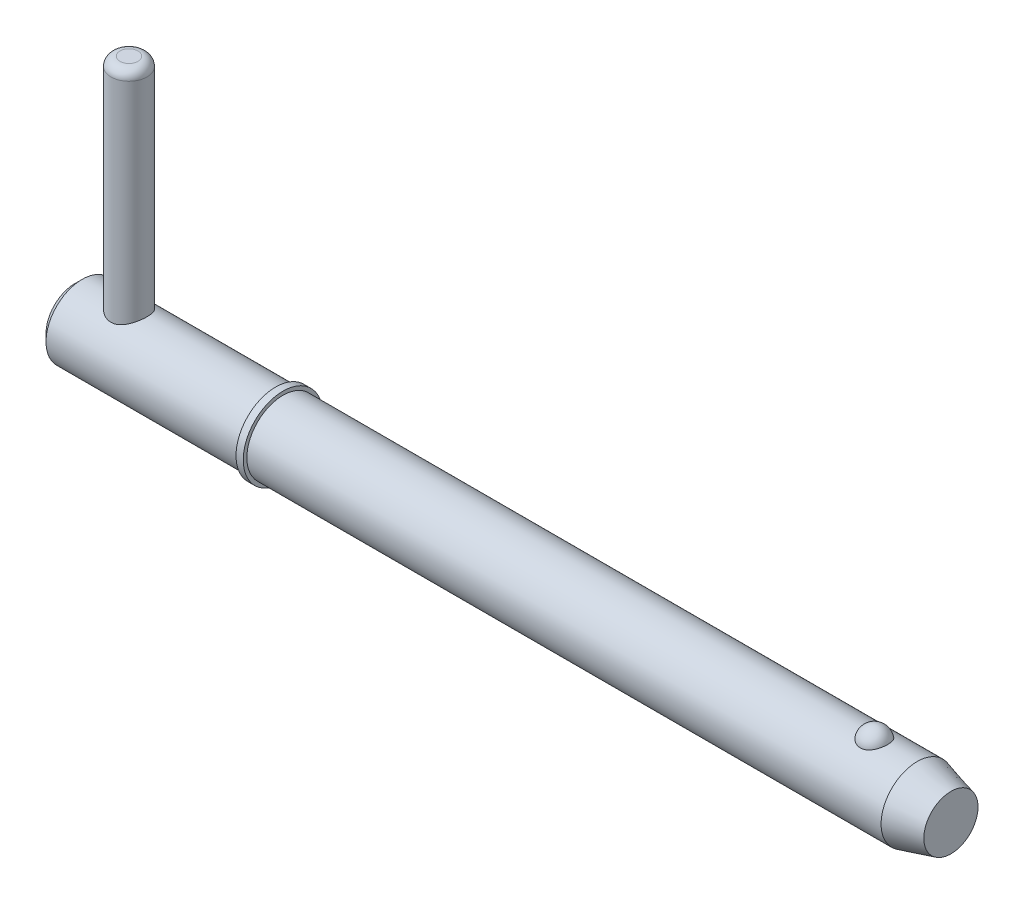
ISO-10303-21;
HEADER;
FILE_DESCRIPTION(('STEP AP214'),'2;1');
FILE_NAME('part.step','',(''),(''),'','','');
FILE_SCHEMA(('AUTOMOTIVE_DESIGN { 1 0 10303 214 1 1 1 1 }'));
ENDSEC;
DATA;
#1=APPLICATION_CONTEXT('core data for automotive mechanical design processes');
#2=APPLICATION_PROTOCOL_DEFINITION('international standard','automotive_design',2000,#1);
#3=PRODUCT_CONTEXT('',#1,'mechanical');
#4=PRODUCT('Part','Part','',(#3));
#5=PRODUCT_RELATED_PRODUCT_CATEGORY('part','',(#4));
#6=PRODUCT_DEFINITION_FORMATION('','',#4);
#7=PRODUCT_DEFINITION_CONTEXT('part definition',#1,'design');
#8=PRODUCT_DEFINITION('design','',#6,#7);
#9=PRODUCT_DEFINITION_SHAPE('','',#8);
#10=(LENGTH_UNIT() NAMED_UNIT(*) SI_UNIT(.MILLI.,.METRE.));
#11=(NAMED_UNIT(*) PLANE_ANGLE_UNIT() SI_UNIT($,.RADIAN.));
#12=(NAMED_UNIT(*) SI_UNIT($,.STERADIAN.) SOLID_ANGLE_UNIT());
#13=UNCERTAINTY_MEASURE_WITH_UNIT(LENGTH_MEASURE(1.E-05),#10,'distance_accuracy_value','');
#14=(GEOMETRIC_REPRESENTATION_CONTEXT(3) GLOBAL_UNCERTAINTY_ASSIGNED_CONTEXT((#13)) GLOBAL_UNIT_ASSIGNED_CONTEXT((#10,
#11,#12)) REPRESENTATION_CONTEXT('',''));
#15=CARTESIAN_POINT('',(0.,0.,0.));
#16=DIRECTION('',(0.,0.,1.));
#17=DIRECTION('',(1.,0.,0.));
#18=AXIS2_PLACEMENT_3D('',#15,#16,#17);
#19=CARTESIAN_POINT('',(4.755,22.225,0.));
#20=DIRECTION('',(0.,-1.,0.));
#21=DIRECTION('',(0.,0.,-1.));
#22=AXIS2_PLACEMENT_3D('',#19,#20,#21);
#23=CYLINDRICAL_SURFACE('',#22,1.585);
#24=CARTESIAN_POINT('',(4.755,-2.3825,0.));
#25=DIRECTION('',(0.,1.,0.));
#26=DIRECTION('',(0.,0.,1.));
#27=AXIS2_PLACEMENT_3D('',#24,#25,#26);
#28=CIRCLE('',#27,1.585);
#29=CARTESIAN_POINT('',(4.755,-2.3825,1.585));
#30=VERTEX_POINT('',#29);
#31=EDGE_CURVE('P0_E25',#30,#30,#28,.T.);
#32=ORIENTED_EDGE('',*,*,#31,.T.);
#33=EDGE_LOOP('',(#32));
#34=FACE_BOUND('',#33,.T.);
#35=CARTESIAN_POINT('',(4.755,21.4325,0.));
#36=DIRECTION('',(0.,1.,0.));
#37=DIRECTION('',(0.,0.,1.));
#38=AXIS2_PLACEMENT_3D('',#35,#36,#37);
#39=CIRCLE('',#38,1.585);
#40=CARTESIAN_POINT('',(4.755,21.4325,1.585));
#41=VERTEX_POINT('',#40);
#42=EDGE_CURVE('P0_E29',#41,#41,#39,.F.);
#43=ORIENTED_EDGE('',*,*,#42,.T.);
#44=EDGE_LOOP('',(#43));
#45=FACE_BOUND('',#44,.T.);
#46=ADVANCED_FACE('P0_F14',(#34,#45),#23,.T.);
#47=CARTESIAN_POINT('',(4.755,22.225,0.));
#48=DIRECTION('',(0.,1.,0.));
#49=DIRECTION('',(0.,0.,1.));
#50=AXIS2_PLACEMENT_3D('',#47,#48,#49);
#51=PLANE('',#50);
#52=CARTESIAN_POINT('',(4.755,22.225,0.));
#53=DIRECTION('',(0.,1.,0.));
#54=DIRECTION('',(0.,0.,1.));
#55=AXIS2_PLACEMENT_3D('',#52,#53,#54);
#56=CIRCLE('',#55,0.7925);
#57=CARTESIAN_POINT('',(4.755,22.225,0.7925));
#58=VERTEX_POINT('',#57);
#59=EDGE_CURVE('P0_E10',#58,#58,#56,.T.);
#60=ORIENTED_EDGE('',*,*,#59,.T.);
#61=EDGE_LOOP('',(#60));
#62=FACE_BOUND('',#61,.T.);
#63=ADVANCED_FACE('P0_F46',(#62),#51,.T.);
#64=CARTESIAN_POINT('',(4.755,-3.175,0.));
#65=DIRECTION('',(0.,1.,0.));
#66=DIRECTION('',(0.,0.,1.));
#67=AXIS2_PLACEMENT_3D('',#64,#65,#66);
#68=PLANE('',#67);
#69=CARTESIAN_POINT('',(4.755,-3.175,0.));
#70=DIRECTION('',(0.,1.,0.));
#71=DIRECTION('',(0.,0.,1.));
#72=AXIS2_PLACEMENT_3D('',#69,#70,#71);
#73=CIRCLE('',#72,0.7925);
#74=CARTESIAN_POINT('',(4.755,-3.175,0.7925));
#75=VERTEX_POINT('',#74);
#76=EDGE_CURVE('P0_E21',#75,#75,#73,.F.);
#77=ORIENTED_EDGE('',*,*,#76,.T.);
#78=EDGE_LOOP('',(#77));
#79=FACE_BOUND('',#78,.T.);
#80=ADVANCED_FACE('P0_F43',(#79),#68,.F.);
#81=CARTESIAN_POINT('',(4.755,-2.3825,0.));
#82=DIRECTION('',(0.,1.,0.));
#83=DIRECTION('',(0.,0.,1.));
#84=AXIS2_PLACEMENT_3D('',#81,#82,#83);
#85=DEGENERATE_TOROIDAL_SURFACE('',#84,0.7925,0.7925,.T.);
#86=ORIENTED_EDGE('',*,*,#76,.F.);
#87=EDGE_LOOP('',(#86));
#88=FACE_BOUND('',#87,.T.);
#89=ORIENTED_EDGE('',*,*,#31,.F.);
#90=EDGE_LOOP('',(#89));
#91=FACE_BOUND('',#90,.T.);
#92=ADVANCED_FACE('P0_F38',(#88,#91),#85,.T.);
#93=CARTESIAN_POINT('',(4.755,21.4325,0.));
#94=DIRECTION('',(0.,1.,0.));
#95=DIRECTION('',(0.,0.,1.));
#96=AXIS2_PLACEMENT_3D('',#93,#94,#95);
#97=DEGENERATE_TOROIDAL_SURFACE('',#96,0.7925,0.7925,.T.);
#98=ORIENTED_EDGE('',*,*,#42,.F.);
#99=EDGE_LOOP('',(#98));
#100=FACE_BOUND('',#99,.T.);
#101=ORIENTED_EDGE('',*,*,#59,.F.);
#102=EDGE_LOOP('',(#101));
#103=FACE_BOUND('',#102,.T.);
#104=ADVANCED_FACE('P0_F16',(#100,#103),#97,.T.);
#105=CLOSED_SHELL('',(#46,#63,#80,#92,#104));
#106=MANIFOLD_SOLID_BREP('P0_B1',#105);
#107=CARTESIAN_POINT('',(0.,0.,0.));
#108=DIRECTION('',(1.,0.,0.));
#109=DIRECTION('',(0.,0.,-1.));
#110=AXIS2_PLACEMENT_3D('',#107,#108,#109);
#111=CYLINDRICAL_SURFACE('',#110,3.175);
#112=CARTESIAN_POINT('',(74.0476846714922,0.,0.));
#113=DIRECTION('',(1.,0.,0.));
#114=DIRECTION('',(0.,0.,-1.));
#115=AXIS2_PLACEMENT_3D('',#112,#113,#114);
#116=CIRCLE('',#115,3.175);
#117=CARTESIAN_POINT('',(74.0476846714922,0.,-3.175));
#118=VERTEX_POINT('',#117);
#119=EDGE_CURVE('P1_E81',#118,#118,#116,.T.);
#120=ORIENTED_EDGE('',*,*,#119,.F.);
#121=EDGE_LOOP('',(#120));
#122=FACE_BOUND('',#121,.T.);
#123=CARTESIAN_POINT('',(18.29,0.,0.));
#124=DIRECTION('',(1.,0.,0.));
#125=DIRECTION('',(0.,0.,-1.));
#126=AXIS2_PLACEMENT_3D('',#123,#124,#125);
#127=CIRCLE('',#126,3.175);
#128=CARTESIAN_POINT('',(18.29,0.,-3.175));
#129=VERTEX_POINT('',#128);
#130=EDGE_CURVE('P1_E85',#129,#129,#127,.T.);
#131=ORIENTED_EDGE('',*,*,#130,.T.);
#132=EDGE_LOOP('',(#131));
#133=FACE_BOUND('',#132,.T.);
#134=CARTESIAN_POINT('',(70.2757276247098,2.92898950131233,1.2254164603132));
#135=CARTESIAN_POINT('',(70.212316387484,2.92899434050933,1.22541146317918));
#136=CARTESIAN_POINT('',(70.1487979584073,2.93112688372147,1.2203464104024));
#137=CARTESIAN_POINT('',(70.0235306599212,2.93942752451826,1.20020949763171));
#138=CARTESIAN_POINT('',(69.9617869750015,2.9456063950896,1.1851109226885));
#139=CARTESIAN_POINT('',(69.8420651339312,2.96127115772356,1.14540352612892));
#140=CARTESIAN_POINT('',(69.7840775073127,2.97074831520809,1.12081980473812));
#141=CARTESIAN_POINT('',(69.6731943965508,2.99197584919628,1.06285154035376));
#142=CARTESIAN_POINT('',(69.6202966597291,3.0037252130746,1.02947091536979));
#143=CARTESIAN_POINT('',(69.5192688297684,3.02865714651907,0.953674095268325));
#144=CARTESIAN_POINT('',(69.471324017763,3.04187163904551,0.911021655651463));
#145=CARTESIAN_POINT('',(69.3830360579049,3.06808741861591,0.818400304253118));
#146=CARTESIAN_POINT('',(69.3426952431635,3.08108863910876,0.768429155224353));
#147=CARTESIAN_POINT('',(69.2688039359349,3.10614903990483,0.660064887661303));
#148=CARTESIAN_POINT('',(69.2356330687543,3.11814104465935,0.601396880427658));
#149=CARTESIAN_POINT('',(69.1791190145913,3.13926931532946,0.479026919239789));
#150=CARTESIAN_POINT('',(69.1557764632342,3.14840539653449,0.415324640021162));
#151=CARTESIAN_POINT('',(69.1191785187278,3.16298160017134,0.283885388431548));
#152=CARTESIAN_POINT('',(69.1060407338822,3.16837855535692,0.216110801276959));
#153=CARTESIAN_POINT('',(69.0905676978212,3.17475386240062,0.0791367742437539));
#154=CARTESIAN_POINT('',(69.088232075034,3.17573236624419,0.00993738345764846));
#155=CARTESIAN_POINT('',(69.094388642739,3.17318075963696,-0.127420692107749));
#156=CARTESIAN_POINT('',(69.1028073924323,3.16968122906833,-0.19558325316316));
#157=CARTESIAN_POINT('',(69.1301752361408,3.1585790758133,-0.329413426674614));
#158=CARTESIAN_POINT('',(69.1491245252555,3.15097637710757,-0.395080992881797));
#159=CARTESIAN_POINT('',(69.1972057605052,3.13242485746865,-0.5221806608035));
#160=CARTESIAN_POINT('',(69.2263524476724,3.12147119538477,-0.583606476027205));
#161=CARTESIAN_POINT('',(69.2942352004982,3.09734973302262,-0.700436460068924));
#162=CARTESIAN_POINT('',(69.332972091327,3.08418174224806,-0.755840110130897));
#163=CARTESIAN_POINT('',(69.4194771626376,3.05694884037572,-0.859404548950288));
#164=CARTESIAN_POINT('',(69.4672961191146,3.04287919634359,-0.907521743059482));
#165=CARTESIAN_POINT('',(69.5707353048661,3.01548927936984,-0.994758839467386));
#166=CARTESIAN_POINT('',(69.6263549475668,3.0021689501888,-1.03387941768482));
#167=CARTESIAN_POINT('',(69.7428093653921,2.97810316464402,-1.10126594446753));
#168=CARTESIAN_POINT('',(69.8035182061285,2.96731170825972,-1.12973256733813));
#169=CARTESIAN_POINT('',(69.9293712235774,2.94928934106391,-1.17598467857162));
#170=CARTESIAN_POINT('',(69.9945137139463,2.94205708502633,-1.19377420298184));
#171=CARTESIAN_POINT('',(70.1238562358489,2.93233065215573,-1.21746387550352));
#172=CARTESIAN_POINT('',(70.1879385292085,2.92961621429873,-1.22391763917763));
#173=CARTESIAN_POINT('',(70.3163375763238,2.92855752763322,-1.22644976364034));
#174=CARTESIAN_POINT('',(70.3806542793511,2.93021238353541,-1.22253024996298));
#175=CARTESIAN_POINT('',(70.5055239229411,2.9375685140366,-1.20474140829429));
#176=CARTESIAN_POINT('',(70.566131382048,2.94313790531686,-1.19119621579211));
#177=CARTESIAN_POINT('',(70.6841106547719,2.95756226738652,-1.15491492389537));
#178=CARTESIAN_POINT('',(70.7414822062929,2.96641750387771,-1.13217808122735));
#179=CARTESIAN_POINT('',(70.8527699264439,2.98669918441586,-1.07755083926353));
#180=CARTESIAN_POINT('',(70.9065845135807,2.9981771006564,-1.04547308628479));
#181=CARTESIAN_POINT('',(71.0081473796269,3.02240235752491,-0.973220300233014));
#182=CARTESIAN_POINT('',(71.0558942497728,3.03514999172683,-0.933043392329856));
#183=CARTESIAN_POINT('',(71.1465817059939,3.06131230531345,-0.843372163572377));
#184=CARTESIAN_POINT('',(71.1891588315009,3.07472822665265,-0.793510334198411));
#185=CARTESIAN_POINT('',(71.2656765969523,3.10021106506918,-0.687241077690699));
#186=CARTESIAN_POINT('',(71.2996156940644,3.1122777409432,-0.630832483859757));
#187=CARTESIAN_POINT('',(71.3591209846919,3.134208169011,-0.51105938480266));
#188=CARTESIAN_POINT('',(71.3843892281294,3.14399040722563,-0.447531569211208));
#189=CARTESIAN_POINT('',(71.4245117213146,3.15983820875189,-0.31682749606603));
#190=CARTESIAN_POINT('',(71.4393659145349,3.16590375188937,-0.249651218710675));
#191=CARTESIAN_POINT('',(71.458358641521,3.17370076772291,-0.113549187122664));
#192=CARTESIAN_POINT('',(71.4624966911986,3.17543204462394,-0.0446233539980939));
#193=CARTESIAN_POINT('',(71.4599697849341,3.17438372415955,0.0929938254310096));
#194=CARTESIAN_POINT('',(71.4533050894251,3.17160423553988,0.16168517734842));
#195=CARTESIAN_POINT('',(71.4293754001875,3.1618438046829,0.296502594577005));
#196=CARTESIAN_POINT('',(71.4121674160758,3.15488546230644,0.362640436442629));
#197=CARTESIAN_POINT('',(71.367547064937,3.13748892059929,0.490896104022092));
#198=CARTESIAN_POINT('',(71.3401339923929,3.12705048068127,0.553013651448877));
#199=CARTESIAN_POINT('',(71.2754626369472,3.10369139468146,0.671876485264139));
#200=CARTESIAN_POINT('',(71.2381467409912,3.0907563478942,0.72858760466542));
#201=CARTESIAN_POINT('',(71.1545246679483,3.06381731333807,0.834653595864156));
#202=CARTESIAN_POINT('',(71.1082189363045,3.04981337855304,0.884008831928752));
#203=CARTESIAN_POINT('',(71.007718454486,3.02230423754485,0.973916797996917));
#204=CARTESIAN_POINT('',(70.953535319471,3.00879833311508,1.01448227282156));
#205=CARTESIAN_POINT('',(70.8385299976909,2.98383625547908,1.0857155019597));
#206=CARTESIAN_POINT('',(70.7777053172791,2.9723808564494,1.11637952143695));
#207=CARTESIAN_POINT('',(70.6533690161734,2.95329063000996,1.16592590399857));
#208=CARTESIAN_POINT('',(70.5900230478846,2.9455373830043,1.18517901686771));
#209=CARTESIAN_POINT('',(70.4607664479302,2.9342556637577,1.21284802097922));
#210=CARTESIAN_POINT('',(70.3948641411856,2.93071450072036,1.2212964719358));
#211=CARTESIAN_POINT('',(70.311116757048,2.9291525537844,1.22502505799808));
#212=CARTESIAN_POINT('',(70.2934263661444,2.92898815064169,1.22541785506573));
#213=CARTESIAN_POINT('',(70.2757276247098,2.92898950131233,1.2254164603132));
#214=B_SPLINE_CURVE_WITH_KNOTS('',3,(#134,#135,#136,#137,#138,#139,#140,#141,#142,#143,#144,
#145,#146,#147,#148,#149,#150,#151,#152,#153,#154,#155,#156,#157,#158,#159,#160,#161,#162,#163,
#164,#165,#166,#167,#168,#169,#170,#171,#172,#173,#174,#175,#176,#177,#178,#179,#180,#181,#182,
#183,#184,#185,#186,#187,#188,#189,#190,#191,#192,#193,#194,#195,#196,#197,#198,#199,#200,#201,
#202,#203,#204,#205,#206,#207,#208,#209,#210,#211,#212,#213),.UNSPECIFIED.,.T.,.F.,(4,2,2,2,2,2,
2,2,2,2,2,2,2,2,2,2,2,2,2,2,2,2,2,2,2,2,2,2,2,2,2,2,2,2,2,2,2,2,2,4),(0.,0.190186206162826,
0.380880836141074,0.571074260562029,0.761183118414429,0.956866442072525,1.15260970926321,
1.3570177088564,1.56143892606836,1.76818248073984,1.97491892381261,2.18025109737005,
2.38558707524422,2.59122111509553,2.79687285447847,3.00371012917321,3.2105318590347,
3.41323429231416,3.61586005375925,3.80828192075,4.00066436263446,4.18685798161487,
4.37306665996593,4.56330302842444,4.75358348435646,4.95345287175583,5.15335793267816,
5.35957003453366,5.56578325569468,5.7720057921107,5.97822335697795,6.18333558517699,
6.38846199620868,6.59480900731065,6.80114579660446,7.00718137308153,7.21329457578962,
7.41228022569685,7.61066481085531,7.66374777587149),.UNSPECIFIED.);
#215=CARTESIAN_POINT('',(70.2757276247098,2.92898950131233,1.2254164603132));
#216=VERTEX_POINT('',#215);
#217=EDGE_CURVE('P1_E35',#216,#216,#214,.T.);
#218=ORIENTED_EDGE('',*,*,#217,.T.);
#219=EDGE_LOOP('',(#218));
#220=FACE_BOUND('',#219,.T.);
#221=ADVANCED_FACE('P1_F13',(#122,#133,#220),#111,.T.);
#222=CARTESIAN_POINT('',(0.,0.,0.));
#223=DIRECTION('',(-1.,0.,0.));
#224=DIRECTION('',(0.,0.,1.));
#225=AXIS2_PLACEMENT_3D('',#222,#223,#224);
#226=PLANE('',#225);
#227=CARTESIAN_POINT('',(0.,0.,0.));
#228=DIRECTION('',(1.,0.,0.));
#229=DIRECTION('',(0.,0.,-1.));
#230=AXIS2_PLACEMENT_3D('',#227,#228,#229);
#231=CIRCLE('',#230,2.54);
#232=CARTESIAN_POINT('',(0.,0.,-2.54));
#233=VERTEX_POINT('',#232);
#234=EDGE_CURVE('P1_E9',#233,#233,#231,.T.);
#235=ORIENTED_EDGE('',*,*,#234,.F.);
#236=EDGE_LOOP('',(#235));
#237=FACE_BOUND('',#236,.T.);
#238=ADVANCED_FACE('P1_F15',(#237),#226,.T.);
#239=CARTESIAN_POINT('',(0.634999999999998,0.,0.));
#240=DIRECTION('',(1.,0.,0.));
#241=DIRECTION('',(0.,0.,-1.));
#242=AXIS2_PLACEMENT_3D('',#239,#240,#241);
#243=CONICAL_SURFACE('',#242,3.175,0.78539816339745);
#244=ORIENTED_EDGE('',*,*,#234,.T.);
#245=EDGE_LOOP('',(#244));
#246=FACE_BOUND('',#245,.T.);
#247=CARTESIAN_POINT('',(0.634999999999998,0.,0.));
#248=DIRECTION('',(1.,0.,0.));
#249=DIRECTION('',(0.,0.,-1.));
#250=AXIS2_PLACEMENT_3D('',#247,#248,#249);
#251=CIRCLE('',#250,3.175);
#252=CARTESIAN_POINT('',(0.634999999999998,0.,-3.175));
#253=VERTEX_POINT('',#252);
#254=EDGE_CURVE('P1_E26',#253,#253,#251,.T.);
#255=ORIENTED_EDGE('',*,*,#254,.F.);
#256=EDGE_LOOP('',(#255));
#257=FACE_BOUND('',#256,.T.);
#258=ADVANCED_FACE('P1_F77',(#246,#257),#243,.T.);
#259=CARTESIAN_POINT('',(0.,0.,0.));
#260=DIRECTION('',(1.,0.,0.));
#261=DIRECTION('',(0.,0.,-1.));
#262=AXIS2_PLACEMENT_3D('',#259,#260,#261);
#263=CYLINDRICAL_SURFACE('',#262,3.175);
#264=CARTESIAN_POINT('',(4.755,-2.75107251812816,1.585));
#265=CARTESIAN_POINT('',(4.67238891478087,-2.7510796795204,1.58499425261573));
#266=CARTESIAN_POINT('',(4.58967306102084,-2.75485010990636,1.57849830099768));
#267=CARTESIAN_POINT('',(4.42677850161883,-2.76938647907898,1.55284486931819));
#268=CARTESIAN_POINT('',(4.34660551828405,-2.78016716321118,1.53366069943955));
#269=CARTESIAN_POINT('',(4.19146029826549,-2.80716278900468,1.48366329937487));
#270=CARTESIAN_POINT('',(4.11646293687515,-2.8233488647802,1.45291173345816));
#271=CARTESIAN_POINT('',(3.97271079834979,-2.85928672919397,1.38084067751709));
#272=CARTESIAN_POINT('',(3.90395634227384,-2.87903870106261,1.33952064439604));
#273=CARTESIAN_POINT('',(3.76839976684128,-2.921867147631,1.24350234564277));
#274=CARTESIAN_POINT('',(3.702222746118,-2.94508343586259,1.18798355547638));
#275=CARTESIAN_POINT('',(3.5796334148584,-2.99109588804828,1.06685014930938));
#276=CARTESIAN_POINT('',(3.52322596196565,-3.01389183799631,1.00123054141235));
#277=CARTESIAN_POINT('',(3.41807024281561,-3.05832598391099,0.856373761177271));
#278=CARTESIAN_POINT('',(3.37009053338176,-3.07978367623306,0.776518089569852));
#279=CARTESIAN_POINT('',(3.28853137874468,-3.11730894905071,0.608596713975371));
#280=CARTESIAN_POINT('',(3.25494287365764,-3.1333799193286,0.520536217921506));
#281=CARTESIAN_POINT('',(3.20559401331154,-3.15731341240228,0.345327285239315));
#282=CARTESIAN_POINT('',(3.18873760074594,-3.16567752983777,0.258557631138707));
#283=CARTESIAN_POINT('',(3.16972238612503,-3.17512718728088,0.0830496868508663));
#284=CARTESIAN_POINT('',(3.16755472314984,-3.17621711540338,-0.00568738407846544));
#285=CARTESIAN_POINT('',(3.1775542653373,-3.17123385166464,-0.174372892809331));
#286=CARTESIAN_POINT('',(3.18849502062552,-3.16577346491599,-0.254416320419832));
#287=CARTESIAN_POINT('',(3.22220680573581,-3.14922844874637,-0.411354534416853));
#288=CARTESIAN_POINT('',(3.2449787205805,-3.13814339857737,-0.488249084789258));
#289=CARTESIAN_POINT('',(3.30185558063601,-3.111172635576,-0.638050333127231));
#290=CARTESIAN_POINT('',(3.33611332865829,-3.09522247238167,-0.710886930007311));
#291=CARTESIAN_POINT('',(3.41477890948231,-3.05996035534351,-0.849953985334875));
#292=CARTESIAN_POINT('',(3.45919037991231,-3.04064719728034,-0.916182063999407));
#293=CARTESIAN_POINT('',(3.5617148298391,-2.99832415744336,-1.04681642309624));
#294=CARTESIAN_POINT('',(3.62072497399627,-2.97513741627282,-1.11046186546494));
#295=CARTESIAN_POINT('',(3.7483697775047,-2.92885066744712,-1.22736291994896));
#296=CARTESIAN_POINT('',(3.81701173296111,-2.90575073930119,-1.2806105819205));
#297=CARTESIAN_POINT('',(3.96727993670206,-2.86067370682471,-1.37849835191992));
#298=CARTESIAN_POINT('',(4.04945242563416,-2.83885964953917,-1.42238246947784));
#299=CARTESIAN_POINT('',(4.2213558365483,-2.80110454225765,-1.49537418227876));
#300=CARTESIAN_POINT('',(4.3110787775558,-2.78515738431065,-1.52449715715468));
#301=CARTESIAN_POINT('',(4.48806324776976,-2.76271292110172,-1.56478065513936));
#302=CARTESIAN_POINT('',(4.57495732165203,-2.75556745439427,-1.57718067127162));
#303=CARTESIAN_POINT('',(4.74985771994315,-2.74969306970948,-1.58740564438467));
#304=CARTESIAN_POINT('',(4.8378632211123,-2.75095824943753,-1.58524082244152));
#305=CARTESIAN_POINT('',(5.00227282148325,-2.76107477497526,-1.56753530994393));
#306=CARTESIAN_POINT('',(5.07889680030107,-2.76908515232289,-1.55347662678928));
#307=CARTESIAN_POINT('',(5.22855309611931,-2.79054849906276,-1.51458035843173));
#308=CARTESIAN_POINT('',(5.30158424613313,-2.80400322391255,-1.489739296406));
#309=CARTESIAN_POINT('',(5.44583114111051,-2.83556995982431,-1.42877335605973));
#310=CARTESIAN_POINT('',(5.51680600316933,-2.85386886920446,-1.39217900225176));
#311=CARTESIAN_POINT('',(5.6520174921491,-2.89289503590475,-1.30915485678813));
#312=CARTESIAN_POINT('',(5.71625063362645,-2.91362353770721,-1.26272001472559));
#313=CARTESIAN_POINT('',(5.8445938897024,-2.95830220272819,-1.15451693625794));
#314=CARTESIAN_POINT('',(5.90767560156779,-2.98233004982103,-1.09155543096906));
#315=CARTESIAN_POINT('',(6.0226995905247,-3.02864458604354,-0.955560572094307));
#316=CARTESIAN_POINT('',(6.07463814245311,-3.05093069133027,-0.882523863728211));
#317=CARTESIAN_POINT('',(6.16704288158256,-3.09200671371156,-0.725836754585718));
#318=CARTESIAN_POINT('',(6.20717458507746,-3.11069030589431,-0.64195924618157));
#319=CARTESIAN_POINT('',(6.27235859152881,-3.1416474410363,-0.467442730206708));
#320=CARTESIAN_POINT('',(6.29742409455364,-3.15392659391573,-0.376809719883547));
#321=CARTESIAN_POINT('',(6.32960989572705,-3.16979844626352,-0.200314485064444));
#322=CARTESIAN_POINT('',(6.33816324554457,-3.17408359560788,-0.114775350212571));
#323=CARTESIAN_POINT('',(6.34130309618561,-3.17565001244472,0.0566108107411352));
#324=CARTESIAN_POINT('',(6.33589445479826,-3.17293371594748,0.142457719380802));
#325=CARTESIAN_POINT('',(6.31221457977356,-3.16120608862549,0.306097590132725));
#326=CARTESIAN_POINT('',(6.2948097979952,-3.15261910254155,0.38404960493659));
#327=CARTESIAN_POINT('',(6.24879775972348,-3.13040364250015,0.535801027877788));
#328=CARTESIAN_POINT('',(6.22018889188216,-3.11677444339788,0.609599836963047));
#329=CARTESIAN_POINT('',(6.15130303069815,-3.08497808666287,0.754502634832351));
#330=CARTESIAN_POINT('',(6.11057850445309,-3.0666414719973,0.82535556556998));
#331=CARTESIAN_POINT('',(6.01917980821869,-3.02735012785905,0.95951596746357));
#332=CARTESIAN_POINT('',(5.96850106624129,-3.00639419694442,1.02281994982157));
#333=CARTESIAN_POINT('',(5.8528006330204,-2.96149402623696,1.1467073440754));
#334=CARTESIAN_POINT('',(5.78685463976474,-2.93745961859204,1.20639723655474));
#335=CARTESIAN_POINT('',(5.64552278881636,-2.89084502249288,1.31419099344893));
#336=CARTESIAN_POINT('',(5.57012871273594,-2.8682661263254,1.36228466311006));
#337=CARTESIAN_POINT('',(5.40892145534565,-2.82661780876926,1.44677201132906));
#338=CARTESIAN_POINT('',(5.32285703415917,-2.80767948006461,1.48275497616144));
#339=CARTESIAN_POINT('',(5.14469010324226,-2.77716572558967,1.53916557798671));
#340=CARTESIAN_POINT('',(5.05260892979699,-2.76556569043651,1.55964525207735));
#341=CARTESIAN_POINT('',(4.92544162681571,-2.75613775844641,1.57618070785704));
#342=CARTESIAN_POINT('',(4.89147210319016,-2.75424493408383,1.57948285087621));
#343=CARTESIAN_POINT('',(4.82334103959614,-2.75171079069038,1.58389375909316));
#344=CARTESIAN_POINT('',(4.78917948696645,-2.75106955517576,1.58500237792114));
#345=CARTESIAN_POINT('',(4.755,-2.75107251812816,1.585));
#346=B_SPLINE_CURVE_WITH_KNOTS('',3,(#264,#265,#266,#267,#268,#269,#270,#271,#272,#273,#274,
#275,#276,#277,#278,#279,#280,#281,#282,#283,#284,#285,#286,#287,#288,#289,#290,#291,#292,#293,
#294,#295,#296,#297,#298,#299,#300,#301,#302,#303,#304,#305,#306,#307,#308,#309,#310,#311,#312,
#313,#314,#315,#316,#317,#318,#319,#320,#321,#322,#323,#324,#325,#326,#327,#328,#329,#330,#331,
#332,#333,#334,#335,#336,#337,#338,#339,#340,#341,#342,#343,#344,#345),.UNSPECIFIED.,.T.,.F.,(4,
2,2,2,2,2,2,2,2,2,2,2,2,2,2,2,2,2,2,2,2,2,2,2,2,2,2,2,2,2,2,2,2,2,2,2,2,2,2,2,4),(0.,
0.247689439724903,0.495901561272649,0.742808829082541,0.989728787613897,1.25694656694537,
1.52429683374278,1.80959781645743,2.0947189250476,2.35960564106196,2.62433255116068,
2.86610932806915,3.1079041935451,3.35305262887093,3.59828902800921,3.86665310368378,
4.13522157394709,4.4207514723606,4.70598326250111,4.9686344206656,5.23110127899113,
5.46499114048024,5.69895647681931,5.94376186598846,6.1886932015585,6.46438263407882,
6.74016408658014,7.0231370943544,7.30586181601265,7.5626977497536,7.81944433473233,
8.05935987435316,8.29930993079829,8.54954401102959,8.79989329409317,9.07508848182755,
9.35052473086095,9.63453318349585,9.91758407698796,10.0200561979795,10.1225351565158),.UNSPECIFIED.);
#347=CARTESIAN_POINT('',(4.755,-2.75107251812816,1.585));
#348=VERTEX_POINT('',#347);
#349=EDGE_CURVE('P1_E17',#348,#348,#346,.T.);
#350=ORIENTED_EDGE('',*,*,#349,.F.);
#351=EDGE_LOOP('',(#350));
#352=FACE_BOUND('',#351,.T.);
#353=CARTESIAN_POINT('',(4.755,2.75107251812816,1.585));
#354=CARTESIAN_POINT('',(4.83761108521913,2.7510796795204,1.58499425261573));
#355=CARTESIAN_POINT('',(4.92032693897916,2.75485010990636,1.57849830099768));
#356=CARTESIAN_POINT('',(5.08322149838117,2.76938647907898,1.55284486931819));
#357=CARTESIAN_POINT('',(5.16339448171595,2.78016716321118,1.53366069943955));
#358=CARTESIAN_POINT('',(5.31853970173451,2.80716278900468,1.48366329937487));
#359=CARTESIAN_POINT('',(5.39353706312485,2.8233488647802,1.45291173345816));
#360=CARTESIAN_POINT('',(5.53728920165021,2.85928672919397,1.38084067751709));
#361=CARTESIAN_POINT('',(5.60604365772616,2.87903870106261,1.33952064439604));
#362=CARTESIAN_POINT('',(5.74160023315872,2.921867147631,1.24350234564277));
#363=CARTESIAN_POINT('',(5.807777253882,2.94508343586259,1.18798355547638));
#364=CARTESIAN_POINT('',(5.9303665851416,2.99109588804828,1.06685014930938));
#365=CARTESIAN_POINT('',(5.98677403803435,3.01389183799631,1.00123054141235));
#366=CARTESIAN_POINT('',(6.09192975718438,3.05832598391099,0.85637376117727));
#367=CARTESIAN_POINT('',(6.13990946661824,3.07978367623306,0.776518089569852));
#368=CARTESIAN_POINT('',(6.22146862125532,3.11730894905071,0.608596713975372));
#369=CARTESIAN_POINT('',(6.25505712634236,3.1333799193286,0.520536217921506));
#370=CARTESIAN_POINT('',(6.30440598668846,3.15731341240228,0.345327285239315));
#371=CARTESIAN_POINT('',(6.32126239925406,3.16567752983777,0.258557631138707));
#372=CARTESIAN_POINT('',(6.34027761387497,3.17512718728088,0.0830496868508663));
#373=CARTESIAN_POINT('',(6.34244527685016,3.17621711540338,-0.00568738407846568));
#374=CARTESIAN_POINT('',(6.3324457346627,3.17123385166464,-0.174372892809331));
#375=CARTESIAN_POINT('',(6.32150497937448,3.16577346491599,-0.254416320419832));
#376=CARTESIAN_POINT('',(6.28779319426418,3.14922844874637,-0.411354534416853));
#377=CARTESIAN_POINT('',(6.2650212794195,3.13814339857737,-0.488249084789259));
#378=CARTESIAN_POINT('',(6.20814441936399,3.111172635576,-0.638050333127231));
#379=CARTESIAN_POINT('',(6.17388667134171,3.09522247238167,-0.710886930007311));
#380=CARTESIAN_POINT('',(6.09522109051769,3.05996035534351,-0.849953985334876));
#381=CARTESIAN_POINT('',(6.05080962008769,3.04064719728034,-0.916182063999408));
#382=CARTESIAN_POINT('',(5.9482851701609,2.99832415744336,-1.04681642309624));
#383=CARTESIAN_POINT('',(5.88927502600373,2.97513741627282,-1.11046186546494));
#384=CARTESIAN_POINT('',(5.7616302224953,2.92885066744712,-1.22736291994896));
#385=CARTESIAN_POINT('',(5.69298826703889,2.90575073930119,-1.2806105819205));
#386=CARTESIAN_POINT('',(5.54272006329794,2.86067370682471,-1.37849835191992));
#387=CARTESIAN_POINT('',(5.46054757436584,2.83885964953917,-1.42238246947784));
#388=CARTESIAN_POINT('',(5.2886441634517,2.80110454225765,-1.49537418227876));
#389=CARTESIAN_POINT('',(5.19892122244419,2.78515738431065,-1.52449715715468));
#390=CARTESIAN_POINT('',(5.02193675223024,2.76271292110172,-1.56478065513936));
#391=CARTESIAN_POINT('',(4.93504267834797,2.75556745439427,-1.57718067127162));
#392=CARTESIAN_POINT('',(4.76014228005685,2.74969306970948,-1.58740564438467));
#393=CARTESIAN_POINT('',(4.6721367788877,2.75095824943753,-1.58524082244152));
#394=CARTESIAN_POINT('',(4.50772717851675,2.76107477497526,-1.56753530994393));
#395=CARTESIAN_POINT('',(4.43110319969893,2.76908515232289,-1.55347662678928));
#396=CARTESIAN_POINT('',(4.28144690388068,2.79054849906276,-1.51458035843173));
#397=CARTESIAN_POINT('',(4.20841575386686,2.80400322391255,-1.489739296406));
#398=CARTESIAN_POINT('',(4.06416885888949,2.83556995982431,-1.42877335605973));
#399=CARTESIAN_POINT('',(3.99319399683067,2.85386886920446,-1.39217900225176));
#400=CARTESIAN_POINT('',(3.8579825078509,2.89289503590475,-1.30915485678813));
#401=CARTESIAN_POINT('',(3.79374936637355,2.91362353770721,-1.26272001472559));
#402=CARTESIAN_POINT('',(3.6654061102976,2.95830220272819,-1.15451693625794));
#403=CARTESIAN_POINT('',(3.60232439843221,2.98233004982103,-1.09155543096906));
#404=CARTESIAN_POINT('',(3.4873004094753,3.02864458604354,-0.955560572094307));
#405=CARTESIAN_POINT('',(3.43536185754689,3.05093069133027,-0.88252386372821));
#406=CARTESIAN_POINT('',(3.34295711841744,3.09200671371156,-0.725836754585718));
#407=CARTESIAN_POINT('',(3.30282541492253,3.11069030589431,-0.64195924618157));
#408=CARTESIAN_POINT('',(3.23764140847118,3.14164744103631,-0.467442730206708));
#409=CARTESIAN_POINT('',(3.21257590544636,3.15392659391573,-0.376809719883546));
#410=CARTESIAN_POINT('',(3.18039010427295,3.16979844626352,-0.200314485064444));
#411=CARTESIAN_POINT('',(3.17183675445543,3.17408359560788,-0.114775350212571));
#412=CARTESIAN_POINT('',(3.16869690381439,3.17565001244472,0.0566108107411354));
#413=CARTESIAN_POINT('',(3.17410554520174,3.17293371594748,0.142457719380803));
#414=CARTESIAN_POINT('',(3.19778542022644,3.16120608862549,0.306097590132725));
#415=CARTESIAN_POINT('',(3.2151902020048,3.15261910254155,0.384049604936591));
#416=CARTESIAN_POINT('',(3.26120224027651,3.13040364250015,0.535801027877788));
#417=CARTESIAN_POINT('',(3.28981110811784,3.11677444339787,0.609599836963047));
#418=CARTESIAN_POINT('',(3.35869696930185,3.08497808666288,0.754502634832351));
#419=CARTESIAN_POINT('',(3.39942149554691,3.0666414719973,0.82535556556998));
#420=CARTESIAN_POINT('',(3.49082019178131,3.02735012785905,0.95951596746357));
#421=CARTESIAN_POINT('',(3.54149893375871,3.00639419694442,1.02281994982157));
#422=CARTESIAN_POINT('',(3.6571993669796,2.96149402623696,1.1467073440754));
#423=CARTESIAN_POINT('',(3.72314536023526,2.93745961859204,1.20639723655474));
#424=CARTESIAN_POINT('',(3.86447721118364,2.89084502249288,1.31419099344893));
#425=CARTESIAN_POINT('',(3.93987128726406,2.8682661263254,1.36228466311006));
#426=CARTESIAN_POINT('',(4.10107854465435,2.82661780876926,1.44677201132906));
#427=CARTESIAN_POINT('',(4.18714296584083,2.80767948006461,1.48275497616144));
#428=CARTESIAN_POINT('',(4.36530989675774,2.77716572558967,1.53916557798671));
#429=CARTESIAN_POINT('',(4.45739107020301,2.76556569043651,1.55964525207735));
#430=CARTESIAN_POINT('',(4.58455837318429,2.75613775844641,1.57618070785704));
#431=CARTESIAN_POINT('',(4.61852789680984,2.75424493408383,1.57948285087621));
#432=CARTESIAN_POINT('',(4.68665896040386,2.75171079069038,1.58389375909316));
#433=CARTESIAN_POINT('',(4.72082051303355,2.75106955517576,1.58500237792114));
#434=CARTESIAN_POINT('',(4.755,2.75107251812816,1.585));
#435=B_SPLINE_CURVE_WITH_KNOTS('',3,(#353,#354,#355,#356,#357,#358,#359,#360,#361,#362,#363,
#364,#365,#366,#367,#368,#369,#370,#371,#372,#373,#374,#375,#376,#377,#378,#379,#380,#381,#382,
#383,#384,#385,#386,#387,#388,#389,#390,#391,#392,#393,#394,#395,#396,#397,#398,#399,#400,#401,
#402,#403,#404,#405,#406,#407,#408,#409,#410,#411,#412,#413,#414,#415,#416,#417,#418,#419,#420,
#421,#422,#423,#424,#425,#426,#427,#428,#429,#430,#431,#432,#433,#434),.UNSPECIFIED.,.T.,.F.,(4,
2,2,2,2,2,2,2,2,2,2,2,2,2,2,2,2,2,2,2,2,2,2,2,2,2,2,2,2,2,2,2,2,2,2,2,2,2,2,2,4),(0.,
0.247689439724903,0.495901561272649,0.742808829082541,0.989728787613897,1.25694656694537,
1.52429683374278,1.80959781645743,2.0947189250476,2.35960564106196,2.62433255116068,
2.86610932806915,3.1079041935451,3.35305262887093,3.59828902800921,3.86665310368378,
4.13522157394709,4.4207514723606,4.70598326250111,4.9686344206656,5.23110127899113,
5.46499114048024,5.69895647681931,5.94376186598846,6.1886932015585,6.46438263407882,
6.74016408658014,7.0231370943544,7.30586181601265,7.5626977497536,7.81944433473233,
8.05935987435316,8.29930993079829,8.54954401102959,8.79989329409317,9.07508848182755,
9.35052473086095,9.63453318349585,9.91758407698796,10.0200561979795,10.1225351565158),.UNSPECIFIED.);
#436=CARTESIAN_POINT('',(4.755,2.75107251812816,1.585));
#437=VERTEX_POINT('',#436);
#438=EDGE_CURVE('P1_E43',#437,#437,#435,.T.);
#439=ORIENTED_EDGE('',*,*,#438,.F.);
#440=EDGE_LOOP('',(#439));
#441=FACE_BOUND('',#440,.T.);
#442=ORIENTED_EDGE('',*,*,#254,.T.);
#443=EDGE_LOOP('',(#442));
#444=FACE_BOUND('',#443,.T.);
#445=CARTESIAN_POINT('',(17.655,0.,0.));
#446=DIRECTION('',(1.,0.,0.));
#447=DIRECTION('',(0.,0.,-1.));
#448=AXIS2_PLACEMENT_3D('',#445,#446,#447);
#449=CIRCLE('',#448,3.175);
#450=CARTESIAN_POINT('',(17.655,0.,-3.175));
#451=VERTEX_POINT('',#450);
#452=EDGE_CURVE('P1_E31',#451,#451,#449,.T.);
#453=ORIENTED_EDGE('',*,*,#452,.F.);
#454=EDGE_LOOP('',(#453));
#455=FACE_BOUND('',#454,.T.);
#456=ADVANCED_FACE('P1_F103',(#352,#441,#444,#455),#263,.T.);
#457=CARTESIAN_POINT('',(17.655,3.175,0.));
#458=DIRECTION('',(-1.,0.,0.));
#459=DIRECTION('',(0.,0.,1.));
#460=AXIS2_PLACEMENT_3D('',#457,#458,#459);
#461=PLANE('',#460);
#462=ORIENTED_EDGE('',*,*,#452,.T.);
#463=EDGE_LOOP('',(#462));
#464=FACE_BOUND('',#463,.T.);
#465=CARTESIAN_POINT('',(17.655,0.,0.));
#466=DIRECTION('',(1.,0.,0.));
#467=DIRECTION('',(0.,0.,-1.));
#468=AXIS2_PLACEMENT_3D('',#465,#466,#467);
#469=CIRCLE('',#468,3.4925);
#470=CARTESIAN_POINT('',(17.655,0.,-3.4925));
#471=VERTEX_POINT('',#470);
#472=EDGE_CURVE('P1_E91',#471,#471,#469,.T.);
#473=ORIENTED_EDGE('',*,*,#472,.F.);
#474=EDGE_LOOP('',(#473));
#475=FACE_BOUND('',#474,.T.);
#476=ADVANCED_FACE('P1_F100',(#464,#475),#461,.T.);
#477=CARTESIAN_POINT('',(0.,0.,0.));
#478=DIRECTION('',(1.,0.,0.));
#479=DIRECTION('',(0.,0.,-1.));
#480=AXIS2_PLACEMENT_3D('',#477,#478,#479);
#481=CYLINDRICAL_SURFACE('',#480,3.4925);
#482=ORIENTED_EDGE('',*,*,#472,.T.);
#483=EDGE_LOOP('',(#482));
#484=FACE_BOUND('',#483,.T.);
#485=CARTESIAN_POINT('',(18.29,0.,0.));
#486=DIRECTION('',(1.,0.,0.));
#487=DIRECTION('',(0.,0.,-1.));
#488=AXIS2_PLACEMENT_3D('',#485,#486,#487);
#489=CIRCLE('',#488,3.4925);
#490=CARTESIAN_POINT('',(18.29,0.,-3.4925));
#491=VERTEX_POINT('',#490);
#492=EDGE_CURVE('P1_E88',#491,#491,#489,.T.);
#493=ORIENTED_EDGE('',*,*,#492,.F.);
#494=EDGE_LOOP('',(#493));
#495=FACE_BOUND('',#494,.T.);
#496=ADVANCED_FACE('P1_F68',(#484,#495),#481,.T.);
#497=CARTESIAN_POINT('',(18.29,3.4925,0.));
#498=DIRECTION('',(1.,0.,0.));
#499=DIRECTION('',(0.,0.,-1.));
#500=AXIS2_PLACEMENT_3D('',#497,#498,#499);
#501=PLANE('',#500);
#502=ORIENTED_EDGE('',*,*,#492,.T.);
#503=EDGE_LOOP('',(#502));
#504=FACE_BOUND('',#503,.T.);
#505=ORIENTED_EDGE('',*,*,#130,.F.);
#506=EDGE_LOOP('',(#505));
#507=FACE_BOUND('',#506,.T.);
#508=ADVANCED_FACE('P1_F62',(#504,#507),#501,.T.);
#509=CARTESIAN_POINT('',(77.01,0.,0.));
#510=DIRECTION('',(-1.,0.,0.));
#511=DIRECTION('',(0.,0.,1.));
#512=AXIS2_PLACEMENT_3D('',#509,#510,#511);
#513=CONICAL_SURFACE('',#512,2.38125000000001,0.26179938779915);
#514=ORIENTED_EDGE('',*,*,#119,.T.);
#515=EDGE_LOOP('',(#514));
#516=FACE_BOUND('',#515,.T.);
#517=CARTESIAN_POINT('',(77.01,0.,0.));
#518=DIRECTION('',(1.,0.,0.));
#519=DIRECTION('',(0.,0.,-1.));
#520=AXIS2_PLACEMENT_3D('',#517,#518,#519);
#521=CIRCLE('',#520,2.38125000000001);
#522=CARTESIAN_POINT('',(77.01,0.,-2.38125000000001));
#523=VERTEX_POINT('',#522);
#524=EDGE_CURVE('P1_E42',#523,#523,#521,.T.);
#525=ORIENTED_EDGE('',*,*,#524,.F.);
#526=EDGE_LOOP('',(#525));
#527=FACE_BOUND('',#526,.T.);
#528=ADVANCED_FACE('P1_F59',(#516,#527),#513,.T.);
#529=CARTESIAN_POINT('',(77.01,2.38125000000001,0.));
#530=DIRECTION('',(1.,0.,0.));
#531=DIRECTION('',(0.,0.,-1.));
#532=AXIS2_PLACEMENT_3D('',#529,#530,#531);
#533=PLANE('',#532);
#534=ORIENTED_EDGE('',*,*,#524,.T.);
#535=EDGE_LOOP('',(#534));
#536=FACE_BOUND('',#535,.T.);
#537=ADVANCED_FACE('P1_F55',(#536),#533,.T.);
#538=CARTESIAN_POINT('',(70.2757276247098,2.8575,0.));
#539=DIRECTION('',(-1.,0.,0.));
#540=DIRECTION('',(0.,1.,0.));
#541=AXIS2_PLACEMENT_3D('',#538,#539,#540);
#542=SPHERICAL_SURFACE('',#541,1.22750000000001);
#543=ORIENTED_EDGE('',*,*,#217,.F.);
#544=EDGE_LOOP('',(#543));
#545=FACE_BOUND('',#544,.T.);
#546=ADVANCED_FACE('P1_F50',(#545),#542,.T.);
#547=CARTESIAN_POINT('',(4.755,-3.4925,0.));
#548=DIRECTION('',(0.,1.,0.));
#549=DIRECTION('',(0.,0.,1.));
#550=AXIS2_PLACEMENT_3D('',#547,#548,#549);
#551=CYLINDRICAL_SURFACE('',#550,1.585);
#552=ORIENTED_EDGE('',*,*,#349,.T.);
#553=EDGE_LOOP('',(#552));
#554=FACE_BOUND('',#553,.T.);
#555=ORIENTED_EDGE('',*,*,#438,.T.);
#556=EDGE_LOOP('',(#555));
#557=FACE_BOUND('',#556,.T.);
#558=ADVANCED_FACE('P1_F54',(#554,#557),#551,.F.);
#559=CLOSED_SHELL('',(#221,#238,#258,#456,#476,#496,#508,#528,#537,#546,#558));
#560=MANIFOLD_SOLID_BREP('P1_B1',#559);
#561=ADVANCED_BREP_SHAPE_REPRESENTATION('',(#18,#106,#560),#14);
#562=SHAPE_DEFINITION_REPRESENTATION(#9,#561);
ENDSEC;
END-ISO-10303-21;
